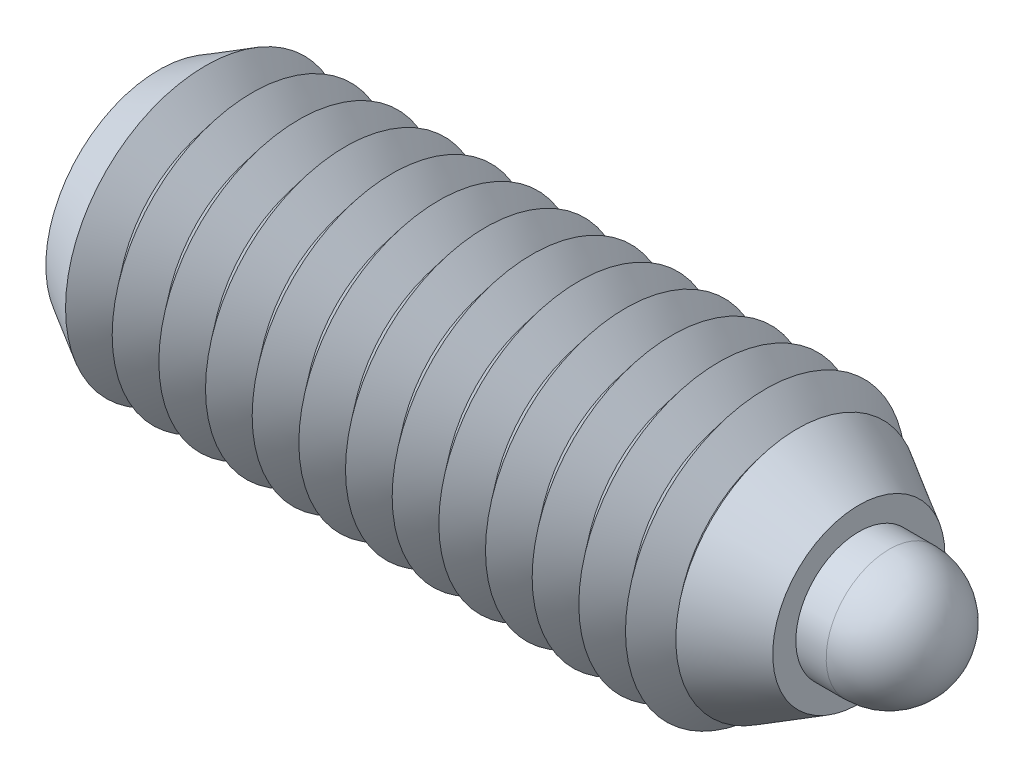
ISO-10303-21;
HEADER;
FILE_DESCRIPTION(('STEP AP214'),'2;1');
FILE_NAME('part.step','',(''),(''),'','','');
FILE_SCHEMA(('AUTOMOTIVE_DESIGN { 1 0 10303 214 1 1 1 1 }'));
ENDSEC;
DATA;
#1=APPLICATION_CONTEXT('core data for automotive mechanical design processes');
#2=APPLICATION_PROTOCOL_DEFINITION('international standard','automotive_design',2000,#1);
#3=PRODUCT_CONTEXT('',#1,'mechanical');
#4=PRODUCT('Part','Part','',(#3));
#5=PRODUCT_RELATED_PRODUCT_CATEGORY('part','',(#4));
#6=PRODUCT_DEFINITION_FORMATION('','',#4);
#7=PRODUCT_DEFINITION_CONTEXT('part definition',#1,'design');
#8=PRODUCT_DEFINITION('design','',#6,#7);
#9=PRODUCT_DEFINITION_SHAPE('','',#8);
#10=(LENGTH_UNIT() NAMED_UNIT(*) SI_UNIT(.MILLI.,.METRE.));
#11=(NAMED_UNIT(*) PLANE_ANGLE_UNIT() SI_UNIT($,.RADIAN.));
#12=(NAMED_UNIT(*) SI_UNIT($,.STERADIAN.) SOLID_ANGLE_UNIT());
#13=UNCERTAINTY_MEASURE_WITH_UNIT(LENGTH_MEASURE(1.E-05),#10,'distance_accuracy_value','');
#14=(GEOMETRIC_REPRESENTATION_CONTEXT(3) GLOBAL_UNCERTAINTY_ASSIGNED_CONTEXT((#13)) GLOBAL_UNIT_ASSIGNED_CONTEXT((#10,
#11,#12)) REPRESENTATION_CONTEXT('',''));
#15=CARTESIAN_POINT('',(0.,0.,0.));
#16=DIRECTION('',(0.,0.,1.));
#17=DIRECTION('',(1.,0.,0.));
#18=AXIS2_PLACEMENT_3D('',#15,#16,#17);
#19=CARTESIAN_POINT('',(13.9,0.,0.));
#20=DIRECTION('',(-1.,0.,0.));
#21=DIRECTION('',(0.,0.,1.));
#22=AXIS2_PLACEMENT_3D('',#19,#20,#21);
#23=CYLINDRICAL_SURFACE('',#22,1.89);
#24=CARTESIAN_POINT('',(11.5,0.,0.));
#25=DIRECTION('',(1.,0.,0.));
#26=DIRECTION('',(0.,0.,-1.));
#27=AXIS2_PLACEMENT_3D('',#24,#25,#26);
#28=CIRCLE('',#27,1.89);
#29=CARTESIAN_POINT('',(11.5,0.,-1.89));
#30=VERTEX_POINT('',#29);
#31=EDGE_CURVE('P0_E21',#30,#30,#28,.T.);
#32=ORIENTED_EDGE('',*,*,#31,.T.);
#33=EDGE_LOOP('',(#32));
#34=FACE_BOUND('',#33,.T.);
#35=CARTESIAN_POINT('',(13.36,0.,0.));
#36=DIRECTION('',(1.,0.,0.));
#37=DIRECTION('',(0.,0.,-1.));
#38=AXIS2_PLACEMENT_3D('',#35,#36,#37);
#39=CIRCLE('',#38,1.89);
#40=CARTESIAN_POINT('',(13.36,0.,-1.89));
#41=VERTEX_POINT('',#40);
#42=EDGE_CURVE('P0_E25',#41,#41,#39,.F.);
#43=ORIENTED_EDGE('',*,*,#42,.T.);
#44=EDGE_LOOP('',(#43));
#45=FACE_BOUND('',#44,.T.);
#46=ADVANCED_FACE('P0_F14',(#34,#45),#23,.T.);
#47=CARTESIAN_POINT('',(10.9,0.,0.));
#48=DIRECTION('',(1.,0.,0.));
#49=DIRECTION('',(0.,0.,-1.));
#50=AXIS2_PLACEMENT_3D('',#47,#48,#49);
#51=PLANE('',#50);
#52=CARTESIAN_POINT('',(10.9,0.,0.));
#53=DIRECTION('',(1.,0.,0.));
#54=DIRECTION('',(0.,0.,-1.));
#55=AXIS2_PLACEMENT_3D('',#52,#53,#54);
#56=CIRCLE('',#55,1.72923048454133);
#57=CARTESIAN_POINT('',(10.9,0.,-1.72923048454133));
#58=VERTEX_POINT('',#57);
#59=EDGE_CURVE('P0_E10',#58,#58,#56,.F.);
#60=ORIENTED_EDGE('',*,*,#59,.T.);
#61=EDGE_LOOP('',(#60));
#62=FACE_BOUND('',#61,.T.);
#63=ADVANCED_FACE('P0_F43',(#62),#51,.F.);
#64=CARTESIAN_POINT('',(15.65,0.,0.));
#65=DIRECTION('',(-1.,0.,0.));
#66=DIRECTION('',(0.,0.,1.));
#67=AXIS2_PLACEMENT_3D('',#64,#65,#66);
#68=CYLINDRICAL_SURFACE('',#67,1.35);
#69=CARTESIAN_POINT('',(15.65,0.,0.));
#70=DIRECTION('',(1.,0.,0.));
#71=DIRECTION('',(0.,0.,-1.));
#72=AXIS2_PLACEMENT_3D('',#69,#70,#71);
#73=CIRCLE('',#72,1.35);
#74=CARTESIAN_POINT('',(15.65,0.,-1.35));
#75=VERTEX_POINT('',#74);
#76=EDGE_CURVE('P0_E29',#75,#75,#73,.T.);
#77=ORIENTED_EDGE('',*,*,#76,.F.);
#78=EDGE_LOOP('',(#77));
#79=FACE_BOUND('',#78,.T.);
#80=CARTESIAN_POINT('',(13.9,0.,0.));
#81=DIRECTION('',(1.,0.,0.));
#82=DIRECTION('',(0.,0.,-1.));
#83=AXIS2_PLACEMENT_3D('',#80,#81,#82);
#84=CIRCLE('',#83,1.35);
#85=CARTESIAN_POINT('',(13.9,0.,-1.35));
#86=VERTEX_POINT('',#85);
#87=EDGE_CURVE('P0_E32',#86,#86,#84,.T.);
#88=ORIENTED_EDGE('',*,*,#87,.T.);
#89=EDGE_LOOP('',(#88));
#90=FACE_BOUND('',#89,.T.);
#91=ADVANCED_FACE('P0_F40',(#79,#90),#68,.T.);
#92=CARTESIAN_POINT('',(15.65,0.,0.));
#93=DIRECTION('',(-1.,0.,0.));
#94=DIRECTION('',(0.,1.,0.));
#95=AXIS2_PLACEMENT_3D('',#92,#93,#94);
#96=SPHERICAL_SURFACE('',#95,1.35);
#97=ORIENTED_EDGE('',*,*,#76,.T.);
#98=EDGE_LOOP('',(#97));
#99=FACE_BOUND('',#98,.T.);
#100=ADVANCED_FACE('P0_F38',(#99),#96,.T.);
#101=CARTESIAN_POINT('',(13.9,0.,0.));
#102=DIRECTION('',(-1.,0.,0.));
#103=DIRECTION('',(0.,0.,1.));
#104=AXIS2_PLACEMENT_3D('',#101,#102,#103);
#105=CONICAL_SURFACE('',#104,1.35,0.785398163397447);
#106=ORIENTED_EDGE('',*,*,#42,.F.);
#107=EDGE_LOOP('',(#106));
#108=FACE_BOUND('',#107,.T.);
#109=ORIENTED_EDGE('',*,*,#87,.F.);
#110=EDGE_LOOP('',(#109));
#111=FACE_BOUND('',#110,.T.);
#112=ADVANCED_FACE('P0_F47',(#108,#111),#105,.T.);
#113=CARTESIAN_POINT('',(11.5,0.,0.));
#114=DIRECTION('',(1.,0.,0.));
#115=DIRECTION('',(0.,0.,-1.));
#116=AXIS2_PLACEMENT_3D('',#113,#114,#115);
#117=CONICAL_SURFACE('',#116,1.89,0.261799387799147);
#118=ORIENTED_EDGE('',*,*,#59,.F.);
#119=EDGE_LOOP('',(#118));
#120=FACE_BOUND('',#119,.T.);
#121=ORIENTED_EDGE('',*,*,#31,.F.);
#122=EDGE_LOOP('',(#121));
#123=FACE_BOUND('',#122,.T.);
#124=ADVANCED_FACE('P0_F16',(#120,#123),#117,.T.);
#125=CLOSED_SHELL('',(#46,#63,#91,#100,#112,#124));
#126=MANIFOLD_SOLID_BREP('P0_B1',#125);
#127=CARTESIAN_POINT('',(15.,0.,0.));
#128=DIRECTION('',(-1.,0.,0.));
#129=DIRECTION('',(0.,0.,1.));
#130=AXIS2_PLACEMENT_3D('',#127,#128,#129);
#131=CONICAL_SURFACE('',#130,1.845,0.523598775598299);
#132=CARTESIAN_POINT('',(15.,0.,0.));
#133=DIRECTION('',(1.,0.,0.));
#134=DIRECTION('',(0.,0.,-1.));
#135=AXIS2_PLACEMENT_3D('',#132,#133,#134);
#136=CIRCLE('',#135,1.845);
#137=CARTESIAN_POINT('',(15.,0.,-1.845));
#138=VERTEX_POINT('',#137);
#139=EDGE_CURVE('P1_E326',#138,#138,#136,.T.);
#140=ORIENTED_EDGE('',*,*,#139,.F.);
#141=EDGE_LOOP('',(#140));
#142=FACE_BOUND('',#141,.T.);
#143=CARTESIAN_POINT('',(13.6833588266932,0.,0.));
#144=DIRECTION('',(1.,0.,0.));
#145=DIRECTION('',(0.,0.,-1.));
#146=AXIS2_PLACEMENT_3D('',#143,#144,#145);
#147=CIRCLE('',#146,2.60516313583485);
#148=CARTESIAN_POINT('',(13.6833588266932,0.,-2.60516313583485));
#149=VERTEX_POINT('',#148);
#150=EDGE_CURVE('P1_E330',#149,#149,#147,.T.);
#151=ORIENTED_EDGE('',*,*,#150,.T.);
#152=EDGE_LOOP('',(#151));
#153=FACE_BOUND('',#152,.T.);
#154=ADVANCED_FACE('P1_F15',(#142,#153),#131,.T.);
#155=CARTESIAN_POINT('',(15.,0.,0.));
#156=DIRECTION('',(1.,0.,0.));
#157=DIRECTION('',(0.,0.,-1.));
#158=AXIS2_PLACEMENT_3D('',#155,#156,#157);
#159=PLANE('',#158);
#160=ORIENTED_EDGE('',*,*,#139,.T.);
#161=EDGE_LOOP('',(#160));
#162=FACE_BOUND('',#161,.T.);
#163=CARTESIAN_POINT('',(15.,0.,0.));
#164=DIRECTION('',(1.,0.,0.));
#165=DIRECTION('',(0.,0.,-1.));
#166=AXIS2_PLACEMENT_3D('',#163,#164,#165);
#167=CIRCLE('',#166,1.35);
#168=CARTESIAN_POINT('',(15.,0.,-1.35));
#169=VERTEX_POINT('',#168);
#170=EDGE_CURVE('P1_E333',#169,#169,#167,.T.);
#171=ORIENTED_EDGE('',*,*,#170,.F.);
#172=EDGE_LOOP('',(#171));
#173=FACE_BOUND('',#172,.T.);
#174=ADVANCED_FACE('P1_F188',(#162,#173),#159,.T.);
#175=CARTESIAN_POINT('',(4.5,0.,0.));
#176=DIRECTION('',(-1.,0.,0.));
#177=DIRECTION('',(0.,0.,1.));
#178=AXIS2_PLACEMENT_3D('',#175,#176,#177);
#179=PLANE('',#178);
#180=CARTESIAN_POINT('',(4.5,0.,0.));
#181=DIRECTION('',(1.,0.,0.));
#182=DIRECTION('',(0.,0.,-1.));
#183=AXIS2_PLACEMENT_3D('',#180,#181,#182);
#184=CIRCLE('',#183,1.89);
#185=CARTESIAN_POINT('',(4.5,0.,-1.89));
#186=VERTEX_POINT('',#185);
#187=EDGE_CURVE('P1_E416',#186,#186,#184,.T.);
#188=ORIENTED_EDGE('',*,*,#187,.T.);
#189=EDGE_LOOP('',(#188));
#190=FACE_BOUND('',#189,.T.);
#191=ADVANCED_FACE('P1_F194',(#190),#179,.F.);
#192=CARTESIAN_POINT('',(15.,0.,0.));
#193=DIRECTION('',(1.,0.,0.));
#194=DIRECTION('',(0.,0.,-1.));
#195=AXIS2_PLACEMENT_3D('',#192,#193,#194);
#196=CYLINDRICAL_SURFACE('',#195,1.89);
#197=ORIENTED_EDGE('',*,*,#187,.F.);
#198=EDGE_LOOP('',(#197));
#199=FACE_BOUND('',#198,.T.);
#200=CARTESIAN_POINT('',(13.5,0.,0.));
#201=DIRECTION('',(1.,0.,0.));
#202=DIRECTION('',(0.,0.,-1.));
#203=AXIS2_PLACEMENT_3D('',#200,#201,#202);
#204=CIRCLE('',#203,1.89);
#205=CARTESIAN_POINT('',(13.5,0.,-1.89));
#206=VERTEX_POINT('',#205);
#207=EDGE_CURVE('P1_E414',#206,#206,#204,.T.);
#208=ORIENTED_EDGE('',*,*,#207,.T.);
#209=EDGE_LOOP('',(#208));
#210=FACE_BOUND('',#209,.T.);
#211=ADVANCED_FACE('P1_F683',(#199,#210),#196,.F.);
#212=CARTESIAN_POINT('',(15.,0.,0.));
#213=DIRECTION('',(-1.,0.,0.));
#214=DIRECTION('',(0.,0.,1.));
#215=AXIS2_PLACEMENT_3D('',#212,#213,#214);
#216=CONICAL_SURFACE('',#215,1.35,0.345555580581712);
#217=ORIENTED_EDGE('',*,*,#207,.F.);
#218=EDGE_LOOP('',(#217));
#219=FACE_BOUND('',#218,.T.);
#220=ORIENTED_EDGE('',*,*,#170,.T.);
#221=EDGE_LOOP('',(#220));
#222=FACE_BOUND('',#221,.T.);
#223=ADVANCED_FACE('P1_F674',(#219,#222),#216,.F.);
#224=CARTESIAN_POINT('',(13.4994813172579,0.,0.));
#225=DIRECTION('',(1.,0.,0.));
#226=DIRECTION('',(0.,0.,-1.));
#227=AXIS2_PLACEMENT_3D('',#224,#225,#226);
#228=CONICAL_SURFACE('',#227,2.37550020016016,0.895664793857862);
#229=ORIENTED_EDGE('',*,*,#150,.F.);
#230=EDGE_LOOP('',(#229));
#231=FACE_BOUND('',#230,.T.);
#232=CARTESIAN_POINT('',(13.4994813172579,0.,0.));
#233=DIRECTION('',(-1.,0.,0.));
#234=DIRECTION('',(0.,0.,1.));
#235=AXIS2_PLACEMENT_3D('',#232,#233,#234);
#236=CIRCLE('',#235,2.37550020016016);
#237=CARTESIAN_POINT('',(13.4994813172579,0.,2.37550020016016));
#238=VERTEX_POINT('',#237);
#239=EDGE_CURVE('P1_E334',#238,#238,#236,.T.);
#240=ORIENTED_EDGE('',*,*,#239,.F.);
#241=EDGE_LOOP('',(#240));
#242=FACE_BOUND('',#241,.T.);
#243=ADVANCED_FACE('P1_F666',(#231,#242),#228,.T.);
#244=CARTESIAN_POINT('',(12.9994813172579,0.,0.));
#245=DIRECTION('',(-1.,0.,0.));
#246=DIRECTION('',(0.,0.,1.));
#247=AXIS2_PLACEMENT_3D('',#244,#245,#246);
#248=CONICAL_SURFACE('',#247,3.,0.895664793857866);
#249=ORIENTED_EDGE('',*,*,#239,.T.);
#250=EDGE_LOOP('',(#249));
#251=FACE_BOUND('',#250,.T.);
#252=CARTESIAN_POINT('',(12.9994813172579,0.,0.));
#253=DIRECTION('',(-1.,0.,0.));
#254=DIRECTION('',(0.,0.,1.));
#255=AXIS2_PLACEMENT_3D('',#252,#253,#254);
#256=CIRCLE('',#255,3.);
#257=CARTESIAN_POINT('',(12.9994813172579,0.,3.));
#258=VERTEX_POINT('',#257);
#259=EDGE_CURVE('P1_E407',#258,#258,#256,.T.);
#260=ORIENTED_EDGE('',*,*,#259,.F.);
#261=EDGE_LOOP('',(#260));
#262=FACE_BOUND('',#261,.T.);
#263=ADVANCED_FACE('P1_F658',(#251,#262),#248,.T.);
#264=CARTESIAN_POINT('',(12.4994813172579,0.,0.));
#265=DIRECTION('',(1.,0.,0.));
#266=DIRECTION('',(0.,0.,-1.));
#267=AXIS2_PLACEMENT_3D('',#264,#265,#266);
#268=CONICAL_SURFACE('',#267,2.37550020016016,0.895664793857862);
#269=ORIENTED_EDGE('',*,*,#259,.T.);
#270=EDGE_LOOP('',(#269));
#271=FACE_BOUND('',#270,.T.);
#272=CARTESIAN_POINT('',(12.4994813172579,0.,0.));
#273=DIRECTION('',(-1.,0.,0.));
#274=DIRECTION('',(0.,0.,1.));
#275=AXIS2_PLACEMENT_3D('',#272,#273,#274);
#276=CIRCLE('',#275,2.37550020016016);
#277=CARTESIAN_POINT('',(12.4994813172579,0.,2.37550020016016));
#278=VERTEX_POINT('',#277);
#279=EDGE_CURVE('P1_E404',#278,#278,#276,.T.);
#280=ORIENTED_EDGE('',*,*,#279,.F.);
#281=EDGE_LOOP('',(#280));
#282=FACE_BOUND('',#281,.T.);
#283=ADVANCED_FACE('P1_F650',(#271,#282),#268,.T.);
#284=CARTESIAN_POINT('',(11.9994813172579,0.,0.));
#285=DIRECTION('',(-1.,0.,0.));
#286=DIRECTION('',(0.,0.,1.));
#287=AXIS2_PLACEMENT_3D('',#284,#285,#286);
#288=CONICAL_SURFACE('',#287,3.,0.895664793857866);
#289=ORIENTED_EDGE('',*,*,#279,.T.);
#290=EDGE_LOOP('',(#289));
#291=FACE_BOUND('',#290,.T.);
#292=CARTESIAN_POINT('',(11.9994813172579,0.,0.));
#293=DIRECTION('',(-1.,0.,0.));
#294=DIRECTION('',(0.,0.,1.));
#295=AXIS2_PLACEMENT_3D('',#292,#293,#294);
#296=CIRCLE('',#295,3.);
#297=CARTESIAN_POINT('',(11.9994813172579,0.,3.));
#298=VERTEX_POINT('',#297);
#299=EDGE_CURVE('P1_E401',#298,#298,#296,.T.);
#300=ORIENTED_EDGE('',*,*,#299,.F.);
#301=EDGE_LOOP('',(#300));
#302=FACE_BOUND('',#301,.T.);
#303=ADVANCED_FACE('P1_F642',(#291,#302),#288,.T.);
#304=CARTESIAN_POINT('',(11.4994813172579,0.,0.));
#305=DIRECTION('',(1.,0.,0.));
#306=DIRECTION('',(0.,0.,-1.));
#307=AXIS2_PLACEMENT_3D('',#304,#305,#306);
#308=CONICAL_SURFACE('',#307,2.37550020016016,0.895664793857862);
#309=ORIENTED_EDGE('',*,*,#299,.T.);
#310=EDGE_LOOP('',(#309));
#311=FACE_BOUND('',#310,.T.);
#312=CARTESIAN_POINT('',(11.4994813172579,0.,0.));
#313=DIRECTION('',(-1.,0.,0.));
#314=DIRECTION('',(0.,0.,1.));
#315=AXIS2_PLACEMENT_3D('',#312,#313,#314);
#316=CIRCLE('',#315,2.37550020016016);
#317=CARTESIAN_POINT('',(11.4994813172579,0.,2.37550020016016));
#318=VERTEX_POINT('',#317);
#319=EDGE_CURVE('P1_E398',#318,#318,#316,.T.);
#320=ORIENTED_EDGE('',*,*,#319,.F.);
#321=EDGE_LOOP('',(#320));
#322=FACE_BOUND('',#321,.T.);
#323=ADVANCED_FACE('P1_F634',(#311,#322),#308,.T.);
#324=CARTESIAN_POINT('',(10.9994813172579,0.,0.));
#325=DIRECTION('',(-1.,0.,0.));
#326=DIRECTION('',(0.,0.,1.));
#327=AXIS2_PLACEMENT_3D('',#324,#325,#326);
#328=CONICAL_SURFACE('',#327,3.,0.895664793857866);
#329=ORIENTED_EDGE('',*,*,#319,.T.);
#330=EDGE_LOOP('',(#329));
#331=FACE_BOUND('',#330,.T.);
#332=CARTESIAN_POINT('',(10.9994813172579,0.,0.));
#333=DIRECTION('',(-1.,0.,0.));
#334=DIRECTION('',(0.,0.,1.));
#335=AXIS2_PLACEMENT_3D('',#332,#333,#334);
#336=CIRCLE('',#335,3.);
#337=CARTESIAN_POINT('',(10.9994813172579,0.,3.));
#338=VERTEX_POINT('',#337);
#339=EDGE_CURVE('P1_E395',#338,#338,#336,.T.);
#340=ORIENTED_EDGE('',*,*,#339,.F.);
#341=EDGE_LOOP('',(#340));
#342=FACE_BOUND('',#341,.T.);
#343=ADVANCED_FACE('P1_F626',(#331,#342),#328,.T.);
#344=CARTESIAN_POINT('',(10.4994813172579,0.,0.));
#345=DIRECTION('',(1.,0.,0.));
#346=DIRECTION('',(0.,0.,-1.));
#347=AXIS2_PLACEMENT_3D('',#344,#345,#346);
#348=CONICAL_SURFACE('',#347,2.37550020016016,0.895664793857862);
#349=ORIENTED_EDGE('',*,*,#339,.T.);
#350=EDGE_LOOP('',(#349));
#351=FACE_BOUND('',#350,.T.);
#352=CARTESIAN_POINT('',(10.4994813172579,0.,0.));
#353=DIRECTION('',(-1.,0.,0.));
#354=DIRECTION('',(0.,0.,1.));
#355=AXIS2_PLACEMENT_3D('',#352,#353,#354);
#356=CIRCLE('',#355,2.37550020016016);
#357=CARTESIAN_POINT('',(10.4994813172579,0.,2.37550020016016));
#358=VERTEX_POINT('',#357);
#359=EDGE_CURVE('P1_E392',#358,#358,#356,.T.);
#360=ORIENTED_EDGE('',*,*,#359,.F.);
#361=EDGE_LOOP('',(#360));
#362=FACE_BOUND('',#361,.T.);
#363=ADVANCED_FACE('P1_F618',(#351,#362),#348,.T.);
#364=CARTESIAN_POINT('',(9.99948131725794,0.,0.));
#365=DIRECTION('',(-1.,0.,0.));
#366=DIRECTION('',(0.,0.,1.));
#367=AXIS2_PLACEMENT_3D('',#364,#365,#366);
#368=CONICAL_SURFACE('',#367,3.,0.895664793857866);
#369=ORIENTED_EDGE('',*,*,#359,.T.);
#370=EDGE_LOOP('',(#369));
#371=FACE_BOUND('',#370,.T.);
#372=CARTESIAN_POINT('',(9.99948131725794,0.,0.));
#373=DIRECTION('',(-1.,0.,0.));
#374=DIRECTION('',(0.,0.,1.));
#375=AXIS2_PLACEMENT_3D('',#372,#373,#374);
#376=CIRCLE('',#375,3.);
#377=CARTESIAN_POINT('',(9.99948131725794,0.,3.));
#378=VERTEX_POINT('',#377);
#379=EDGE_CURVE('P1_E389',#378,#378,#376,.T.);
#380=ORIENTED_EDGE('',*,*,#379,.F.);
#381=EDGE_LOOP('',(#380));
#382=FACE_BOUND('',#381,.T.);
#383=ADVANCED_FACE('P1_F610',(#371,#382),#368,.T.);
#384=CARTESIAN_POINT('',(9.49948131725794,0.,0.));
#385=DIRECTION('',(1.,0.,0.));
#386=DIRECTION('',(0.,0.,-1.));
#387=AXIS2_PLACEMENT_3D('',#384,#385,#386);
#388=CONICAL_SURFACE('',#387,2.37550020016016,0.895664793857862);
#389=ORIENTED_EDGE('',*,*,#379,.T.);
#390=EDGE_LOOP('',(#389));
#391=FACE_BOUND('',#390,.T.);
#392=CARTESIAN_POINT('',(9.49948131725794,0.,0.));
#393=DIRECTION('',(-1.,0.,0.));
#394=DIRECTION('',(0.,0.,1.));
#395=AXIS2_PLACEMENT_3D('',#392,#393,#394);
#396=CIRCLE('',#395,2.37550020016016);
#397=CARTESIAN_POINT('',(9.49948131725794,0.,2.37550020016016));
#398=VERTEX_POINT('',#397);
#399=EDGE_CURVE('P1_E386',#398,#398,#396,.T.);
#400=ORIENTED_EDGE('',*,*,#399,.F.);
#401=EDGE_LOOP('',(#400));
#402=FACE_BOUND('',#401,.T.);
#403=ADVANCED_FACE('P1_F602',(#391,#402),#388,.T.);
#404=CARTESIAN_POINT('',(8.99948131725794,0.,0.));
#405=DIRECTION('',(-1.,0.,0.));
#406=DIRECTION('',(0.,0.,1.));
#407=AXIS2_PLACEMENT_3D('',#404,#405,#406);
#408=CONICAL_SURFACE('',#407,3.,0.895664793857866);
#409=ORIENTED_EDGE('',*,*,#399,.T.);
#410=EDGE_LOOP('',(#409));
#411=FACE_BOUND('',#410,.T.);
#412=CARTESIAN_POINT('',(8.99948131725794,0.,0.));
#413=DIRECTION('',(-1.,0.,0.));
#414=DIRECTION('',(0.,0.,1.));
#415=AXIS2_PLACEMENT_3D('',#412,#413,#414);
#416=CIRCLE('',#415,3.);
#417=CARTESIAN_POINT('',(8.99948131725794,0.,3.));
#418=VERTEX_POINT('',#417);
#419=EDGE_CURVE('P1_E383',#418,#418,#416,.T.);
#420=ORIENTED_EDGE('',*,*,#419,.F.);
#421=EDGE_LOOP('',(#420));
#422=FACE_BOUND('',#421,.T.);
#423=ADVANCED_FACE('P1_F594',(#411,#422),#408,.T.);
#424=CARTESIAN_POINT('',(8.49948131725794,0.,0.));
#425=DIRECTION('',(1.,0.,0.));
#426=DIRECTION('',(0.,0.,-1.));
#427=AXIS2_PLACEMENT_3D('',#424,#425,#426);
#428=CONICAL_SURFACE('',#427,2.37550020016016,0.895664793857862);
#429=ORIENTED_EDGE('',*,*,#419,.T.);
#430=EDGE_LOOP('',(#429));
#431=FACE_BOUND('',#430,.T.);
#432=CARTESIAN_POINT('',(8.49948131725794,0.,0.));
#433=DIRECTION('',(-1.,0.,0.));
#434=DIRECTION('',(0.,0.,1.));
#435=AXIS2_PLACEMENT_3D('',#432,#433,#434);
#436=CIRCLE('',#435,2.37550020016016);
#437=CARTESIAN_POINT('',(8.49948131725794,0.,2.37550020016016));
#438=VERTEX_POINT('',#437);
#439=EDGE_CURVE('P1_E380',#438,#438,#436,.T.);
#440=ORIENTED_EDGE('',*,*,#439,.F.);
#441=EDGE_LOOP('',(#440));
#442=FACE_BOUND('',#441,.T.);
#443=ADVANCED_FACE('P1_F586',(#431,#442),#428,.T.);
#444=CARTESIAN_POINT('',(7.99948131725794,0.,0.));
#445=DIRECTION('',(-1.,0.,0.));
#446=DIRECTION('',(0.,0.,1.));
#447=AXIS2_PLACEMENT_3D('',#444,#445,#446);
#448=CONICAL_SURFACE('',#447,3.,0.895664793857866);
#449=ORIENTED_EDGE('',*,*,#439,.T.);
#450=EDGE_LOOP('',(#449));
#451=FACE_BOUND('',#450,.T.);
#452=CARTESIAN_POINT('',(7.99948131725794,0.,0.));
#453=DIRECTION('',(-1.,0.,0.));
#454=DIRECTION('',(0.,0.,1.));
#455=AXIS2_PLACEMENT_3D('',#452,#453,#454);
#456=CIRCLE('',#455,3.);
#457=CARTESIAN_POINT('',(7.99948131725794,0.,3.));
#458=VERTEX_POINT('',#457);
#459=EDGE_CURVE('P1_E377',#458,#458,#456,.T.);
#460=ORIENTED_EDGE('',*,*,#459,.F.);
#461=EDGE_LOOP('',(#460));
#462=FACE_BOUND('',#461,.T.);
#463=ADVANCED_FACE('P1_F578',(#451,#462),#448,.T.);
#464=CARTESIAN_POINT('',(7.49948131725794,0.,0.));
#465=DIRECTION('',(1.,0.,0.));
#466=DIRECTION('',(0.,0.,-1.));
#467=AXIS2_PLACEMENT_3D('',#464,#465,#466);
#468=CONICAL_SURFACE('',#467,2.37550020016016,0.895664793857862);
#469=ORIENTED_EDGE('',*,*,#459,.T.);
#470=EDGE_LOOP('',(#469));
#471=FACE_BOUND('',#470,.T.);
#472=CARTESIAN_POINT('',(7.49948131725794,0.,0.));
#473=DIRECTION('',(-1.,0.,0.));
#474=DIRECTION('',(0.,0.,1.));
#475=AXIS2_PLACEMENT_3D('',#472,#473,#474);
#476=CIRCLE('',#475,2.37550020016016);
#477=CARTESIAN_POINT('',(7.49948131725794,0.,2.37550020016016));
#478=VERTEX_POINT('',#477);
#479=EDGE_CURVE('P1_E374',#478,#478,#476,.T.);
#480=ORIENTED_EDGE('',*,*,#479,.F.);
#481=EDGE_LOOP('',(#480));
#482=FACE_BOUND('',#481,.T.);
#483=ADVANCED_FACE('P1_F570',(#471,#482),#468,.T.);
#484=CARTESIAN_POINT('',(6.99948131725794,0.,0.));
#485=DIRECTION('',(-1.,0.,0.));
#486=DIRECTION('',(0.,0.,1.));
#487=AXIS2_PLACEMENT_3D('',#484,#485,#486);
#488=CONICAL_SURFACE('',#487,3.,0.895664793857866);
#489=ORIENTED_EDGE('',*,*,#479,.T.);
#490=EDGE_LOOP('',(#489));
#491=FACE_BOUND('',#490,.T.);
#492=CARTESIAN_POINT('',(6.99948131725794,0.,0.));
#493=DIRECTION('',(-1.,0.,0.));
#494=DIRECTION('',(0.,0.,1.));
#495=AXIS2_PLACEMENT_3D('',#492,#493,#494);
#496=CIRCLE('',#495,3.);
#497=CARTESIAN_POINT('',(6.99948131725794,0.,3.));
#498=VERTEX_POINT('',#497);
#499=EDGE_CURVE('P1_E371',#498,#498,#496,.T.);
#500=ORIENTED_EDGE('',*,*,#499,.F.);
#501=EDGE_LOOP('',(#500));
#502=FACE_BOUND('',#501,.T.);
#503=ADVANCED_FACE('P1_F562',(#491,#502),#488,.T.);
#504=CARTESIAN_POINT('',(6.49948131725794,0.,0.));
#505=DIRECTION('',(1.,0.,0.));
#506=DIRECTION('',(0.,0.,-1.));
#507=AXIS2_PLACEMENT_3D('',#504,#505,#506);
#508=CONICAL_SURFACE('',#507,2.37550020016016,0.895664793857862);
#509=ORIENTED_EDGE('',*,*,#499,.T.);
#510=EDGE_LOOP('',(#509));
#511=FACE_BOUND('',#510,.T.);
#512=CARTESIAN_POINT('',(6.49948131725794,0.,0.));
#513=DIRECTION('',(-1.,0.,0.));
#514=DIRECTION('',(0.,0.,1.));
#515=AXIS2_PLACEMENT_3D('',#512,#513,#514);
#516=CIRCLE('',#515,2.37550020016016);
#517=CARTESIAN_POINT('',(6.49948131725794,0.,2.37550020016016));
#518=VERTEX_POINT('',#517);
#519=EDGE_CURVE('P1_E368',#518,#518,#516,.T.);
#520=ORIENTED_EDGE('',*,*,#519,.F.);
#521=EDGE_LOOP('',(#520));
#522=FACE_BOUND('',#521,.T.);
#523=ADVANCED_FACE('P1_F554',(#511,#522),#508,.T.);
#524=CARTESIAN_POINT('',(5.99948131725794,0.,0.));
#525=DIRECTION('',(-1.,0.,0.));
#526=DIRECTION('',(0.,0.,1.));
#527=AXIS2_PLACEMENT_3D('',#524,#525,#526);
#528=CONICAL_SURFACE('',#527,3.,0.895664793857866);
#529=ORIENTED_EDGE('',*,*,#519,.T.);
#530=EDGE_LOOP('',(#529));
#531=FACE_BOUND('',#530,.T.);
#532=CARTESIAN_POINT('',(5.99948131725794,0.,0.));
#533=DIRECTION('',(-1.,0.,0.));
#534=DIRECTION('',(0.,0.,1.));
#535=AXIS2_PLACEMENT_3D('',#532,#533,#534);
#536=CIRCLE('',#535,3.);
#537=CARTESIAN_POINT('',(5.99948131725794,0.,3.));
#538=VERTEX_POINT('',#537);
#539=EDGE_CURVE('P1_E365',#538,#538,#536,.T.);
#540=ORIENTED_EDGE('',*,*,#539,.F.);
#541=EDGE_LOOP('',(#540));
#542=FACE_BOUND('',#541,.T.);
#543=ADVANCED_FACE('P1_F546',(#531,#542),#528,.T.);
#544=CARTESIAN_POINT('',(5.49948131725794,0.,0.));
#545=DIRECTION('',(1.,0.,0.));
#546=DIRECTION('',(0.,0.,-1.));
#547=AXIS2_PLACEMENT_3D('',#544,#545,#546);
#548=CONICAL_SURFACE('',#547,2.37550020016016,0.895664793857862);
#549=ORIENTED_EDGE('',*,*,#539,.T.);
#550=EDGE_LOOP('',(#549));
#551=FACE_BOUND('',#550,.T.);
#552=CARTESIAN_POINT('',(5.49948131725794,0.,0.));
#553=DIRECTION('',(-1.,0.,0.));
#554=DIRECTION('',(0.,0.,1.));
#555=AXIS2_PLACEMENT_3D('',#552,#553,#554);
#556=CIRCLE('',#555,2.37550020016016);
#557=CARTESIAN_POINT('',(5.49948131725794,0.,2.37550020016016));
#558=VERTEX_POINT('',#557);
#559=EDGE_CURVE('P1_E362',#558,#558,#556,.T.);
#560=ORIENTED_EDGE('',*,*,#559,.F.);
#561=EDGE_LOOP('',(#560));
#562=FACE_BOUND('',#561,.T.);
#563=ADVANCED_FACE('P1_F538',(#551,#562),#548,.T.);
#564=CARTESIAN_POINT('',(4.99948131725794,0.,0.));
#565=DIRECTION('',(-1.,0.,0.));
#566=DIRECTION('',(0.,0.,1.));
#567=AXIS2_PLACEMENT_3D('',#564,#565,#566);
#568=CONICAL_SURFACE('',#567,3.,0.895664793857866);
#569=ORIENTED_EDGE('',*,*,#559,.T.);
#570=EDGE_LOOP('',(#569));
#571=FACE_BOUND('',#570,.T.);
#572=CARTESIAN_POINT('',(4.99948131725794,0.,0.));
#573=DIRECTION('',(-1.,0.,0.));
#574=DIRECTION('',(0.,0.,1.));
#575=AXIS2_PLACEMENT_3D('',#572,#573,#574);
#576=CIRCLE('',#575,3.);
#577=CARTESIAN_POINT('',(4.99948131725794,0.,3.));
#578=VERTEX_POINT('',#577);
#579=EDGE_CURVE('P1_E359',#578,#578,#576,.T.);
#580=ORIENTED_EDGE('',*,*,#579,.F.);
#581=EDGE_LOOP('',(#580));
#582=FACE_BOUND('',#581,.T.);
#583=ADVANCED_FACE('P1_F530',(#571,#582),#568,.T.);
#584=CARTESIAN_POINT('',(4.49948131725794,0.,0.));
#585=DIRECTION('',(1.,0.,0.));
#586=DIRECTION('',(0.,0.,-1.));
#587=AXIS2_PLACEMENT_3D('',#584,#585,#586);
#588=CONICAL_SURFACE('',#587,2.37550020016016,0.895664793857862);
#589=ORIENTED_EDGE('',*,*,#579,.T.);
#590=EDGE_LOOP('',(#589));
#591=FACE_BOUND('',#590,.T.);
#592=CARTESIAN_POINT('',(4.49948131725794,0.,0.));
#593=DIRECTION('',(-1.,0.,0.));
#594=DIRECTION('',(0.,0.,1.));
#595=AXIS2_PLACEMENT_3D('',#592,#593,#594);
#596=CIRCLE('',#595,2.37550020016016);
#597=CARTESIAN_POINT('',(4.49948131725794,0.,2.37550020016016));
#598=VERTEX_POINT('',#597);
#599=EDGE_CURVE('P1_E356',#598,#598,#596,.T.);
#600=ORIENTED_EDGE('',*,*,#599,.F.);
#601=EDGE_LOOP('',(#600));
#602=FACE_BOUND('',#601,.T.);
#603=ADVANCED_FACE('P1_F522',(#591,#602),#588,.T.);
#604=CARTESIAN_POINT('',(3.99948131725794,0.,0.));
#605=DIRECTION('',(-1.,0.,0.));
#606=DIRECTION('',(0.,0.,1.));
#607=AXIS2_PLACEMENT_3D('',#604,#605,#606);
#608=CONICAL_SURFACE('',#607,3.,0.895664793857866);
#609=ORIENTED_EDGE('',*,*,#599,.T.);
#610=EDGE_LOOP('',(#609));
#611=FACE_BOUND('',#610,.T.);
#612=CARTESIAN_POINT('',(3.99948131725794,0.,0.));
#613=DIRECTION('',(-1.,0.,0.));
#614=DIRECTION('',(0.,0.,1.));
#615=AXIS2_PLACEMENT_3D('',#612,#613,#614);
#616=CIRCLE('',#615,3.);
#617=CARTESIAN_POINT('',(3.99948131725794,0.,3.));
#618=VERTEX_POINT('',#617);
#619=EDGE_CURVE('P1_E353',#618,#618,#616,.T.);
#620=ORIENTED_EDGE('',*,*,#619,.F.);
#621=EDGE_LOOP('',(#620));
#622=FACE_BOUND('',#621,.T.);
#623=ADVANCED_FACE('P1_F514',(#611,#622),#608,.T.);
#624=CARTESIAN_POINT('',(3.49948131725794,0.,0.));
#625=DIRECTION('',(1.,0.,0.));
#626=DIRECTION('',(0.,0.,-1.));
#627=AXIS2_PLACEMENT_3D('',#624,#625,#626);
#628=CONICAL_SURFACE('',#627,2.37550020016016,0.895664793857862);
#629=ORIENTED_EDGE('',*,*,#619,.T.);
#630=EDGE_LOOP('',(#629));
#631=FACE_BOUND('',#630,.T.);
#632=CARTESIAN_POINT('',(3.49948131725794,0.,0.));
#633=DIRECTION('',(-1.,0.,0.));
#634=DIRECTION('',(0.,0.,1.));
#635=AXIS2_PLACEMENT_3D('',#632,#633,#634);
#636=CIRCLE('',#635,2.37550020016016);
#637=CARTESIAN_POINT('',(3.49948131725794,0.,2.37550020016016));
#638=VERTEX_POINT('',#637);
#639=EDGE_CURVE('P1_E350',#638,#638,#636,.T.);
#640=ORIENTED_EDGE('',*,*,#639,.F.);
#641=EDGE_LOOP('',(#640));
#642=FACE_BOUND('',#641,.T.);
#643=ADVANCED_FACE('P1_F506',(#631,#642),#628,.T.);
#644=CARTESIAN_POINT('',(2.99948131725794,0.,0.));
#645=DIRECTION('',(-1.,0.,0.));
#646=DIRECTION('',(0.,0.,1.));
#647=AXIS2_PLACEMENT_3D('',#644,#645,#646);
#648=CONICAL_SURFACE('',#647,3.,0.895664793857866);
#649=ORIENTED_EDGE('',*,*,#639,.T.);
#650=EDGE_LOOP('',(#649));
#651=FACE_BOUND('',#650,.T.);
#652=CARTESIAN_POINT('',(2.99948131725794,0.,0.));
#653=DIRECTION('',(-1.,0.,0.));
#654=DIRECTION('',(0.,0.,1.));
#655=AXIS2_PLACEMENT_3D('',#652,#653,#654);
#656=CIRCLE('',#655,3.);
#657=CARTESIAN_POINT('',(2.99948131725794,0.,3.));
#658=VERTEX_POINT('',#657);
#659=EDGE_CURVE('P1_E342',#658,#658,#656,.T.);
#660=ORIENTED_EDGE('',*,*,#659,.F.);
#661=EDGE_LOOP('',(#660));
#662=FACE_BOUND('',#661,.T.);
#663=ADVANCED_FACE('P1_F498',(#651,#662),#648,.T.);
#664=CARTESIAN_POINT('',(2.49948131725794,0.,0.));
#665=DIRECTION('',(1.,0.,0.));
#666=DIRECTION('',(0.,0.,-1.));
#667=AXIS2_PLACEMENT_3D('',#664,#665,#666);
#668=CONICAL_SURFACE('',#667,2.37550020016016,0.895664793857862);
#669=ORIENTED_EDGE('',*,*,#659,.T.);
#670=EDGE_LOOP('',(#669));
#671=FACE_BOUND('',#670,.T.);
#672=CARTESIAN_POINT('',(2.49948131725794,0.,0.));
#673=DIRECTION('',(-1.,0.,0.));
#674=DIRECTION('',(0.,0.,1.));
#675=AXIS2_PLACEMENT_3D('',#672,#673,#674);
#676=CIRCLE('',#675,2.37550020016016);
#677=CARTESIAN_POINT('',(2.49948131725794,0.,2.37550020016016));
#678=VERTEX_POINT('',#677);
#679=EDGE_CURVE('P1_E338',#678,#678,#676,.T.);
#680=ORIENTED_EDGE('',*,*,#679,.F.);
#681=EDGE_LOOP('',(#680));
#682=FACE_BOUND('',#681,.T.);
#683=ADVANCED_FACE('P1_F490',(#671,#682),#668,.T.);
#684=CARTESIAN_POINT('',(1.99948131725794,0.,0.));
#685=DIRECTION('',(-1.,0.,0.));
#686=DIRECTION('',(0.,0.,1.));
#687=AXIS2_PLACEMENT_3D('',#684,#685,#686);
#688=CONICAL_SURFACE('',#687,3.,0.895664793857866);
#689=ORIENTED_EDGE('',*,*,#679,.T.);
#690=EDGE_LOOP('',(#689));
#691=FACE_BOUND('',#690,.T.);
#692=CARTESIAN_POINT('',(1.99948131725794,0.,0.));
#693=DIRECTION('',(-1.,0.,0.));
#694=DIRECTION('',(0.,0.,1.));
#695=AXIS2_PLACEMENT_3D('',#692,#693,#694);
#696=CIRCLE('',#695,3.);
#697=CARTESIAN_POINT('',(1.99948131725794,0.,3.));
#698=VERTEX_POINT('',#697);
#699=EDGE_CURVE('P1_E126',#698,#698,#696,.T.);
#700=ORIENTED_EDGE('',*,*,#699,.F.);
#701=EDGE_LOOP('',(#700));
#702=FACE_BOUND('',#701,.T.);
#703=ADVANCED_FACE('P1_F484',(#691,#702),#688,.T.);
#704=CARTESIAN_POINT('',(1.49948131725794,0.,0.));
#705=DIRECTION('',(1.,0.,0.));
#706=DIRECTION('',(0.,0.,-1.));
#707=AXIS2_PLACEMENT_3D('',#704,#705,#706);
#708=CONICAL_SURFACE('',#707,2.37550020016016,0.895664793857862);
#709=ORIENTED_EDGE('',*,*,#699,.T.);
#710=EDGE_LOOP('',(#709));
#711=FACE_BOUND('',#710,.T.);
#712=CARTESIAN_POINT('',(1.49948131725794,0.,0.));
#713=DIRECTION('',(-1.,0.,0.));
#714=DIRECTION('',(0.,0.,1.));
#715=AXIS2_PLACEMENT_3D('',#712,#713,#714);
#716=CIRCLE('',#715,2.37550020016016);
#717=CARTESIAN_POINT('',(1.49948131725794,0.,2.37550020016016));
#718=VERTEX_POINT('',#717);
#719=EDGE_CURVE('P1_E123',#718,#718,#716,.T.);
#720=ORIENTED_EDGE('',*,*,#719,.F.);
#721=EDGE_LOOP('',(#720));
#722=FACE_BOUND('',#721,.T.);
#723=ADVANCED_FACE('P1_F477',(#711,#722),#708,.T.);
#724=CARTESIAN_POINT('',(0.999481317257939,0.,0.));
#725=DIRECTION('',(-1.,0.,0.));
#726=DIRECTION('',(0.,0.,1.));
#727=AXIS2_PLACEMENT_3D('',#724,#725,#726);
#728=CONICAL_SURFACE('',#727,3.,0.895664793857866);
#729=CARTESIAN_POINT('',(0.999727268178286,0.,0.));
#730=DIRECTION('',(-1.,0.,0.));
#731=DIRECTION('',(0.,0.,1.));
#732=AXIS2_PLACEMENT_3D('',#729,#730,#731);
#733=CIRCLE('',#732,2.99969280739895);
#734=CARTESIAN_POINT('',(0.999727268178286,0.,2.99969280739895));
#735=VERTEX_POINT('',#734);
#736=EDGE_CURVE('P1_E336',#735,#735,#733,.T.);
#737=ORIENTED_EDGE('',*,*,#736,.F.);
#738=EDGE_LOOP('',(#737));
#739=FACE_BOUND('',#738,.T.);
#740=ORIENTED_EDGE('',*,*,#719,.T.);
#741=EDGE_LOOP('',(#740));
#742=FACE_BOUND('',#741,.T.);
#743=ADVANCED_FACE('P1_F145',(#739,#742),#728,.T.);
#744=CARTESIAN_POINT('',(0.,0.,0.));
#745=DIRECTION('',(1.,0.,0.));
#746=DIRECTION('',(0.,0.,-1.));
#747=AXIS2_PLACEMENT_3D('',#744,#745,#746);
#748=PLANE('',#747);
#749=CARTESIAN_POINT('',(0.,0.,0.));
#750=DIRECTION('',(1.,0.,0.));
#751=DIRECTION('',(0.,0.,-1.));
#752=AXIS2_PLACEMENT_3D('',#749,#750,#751);
#753=CIRCLE('',#752,2.4225);
#754=CARTESIAN_POINT('',(0.,0.,-2.4225));
#755=VERTEX_POINT('',#754);
#756=EDGE_CURVE('P1_E249',#755,#755,#753,.F.);
#757=ORIENTED_EDGE('',*,*,#756,.T.);
#758=EDGE_LOOP('',(#757));
#759=FACE_BOUND('',#758,.T.);
#760=CARTESIAN_POINT('',(0.,0.,0.));
#761=DIRECTION('',(1.,0.,0.));
#762=DIRECTION('',(0.,0.,-1.));
#763=AXIS2_PLACEMENT_3D('',#760,#761,#762);
#764=CIRCLE('',#763,1.73205080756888);
#765=CARTESIAN_POINT('',(0.,-0.866025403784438,-1.5));
#766=VERTEX_POINT('',#765);
#767=CARTESIAN_POINT('',(0.,0.866025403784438,-1.5));
#768=VERTEX_POINT('',#767);
#769=EDGE_CURVE('P1_E19',#766,#768,#764,.T.);
#770=ORIENTED_EDGE('',*,*,#769,.T.);
#771=CARTESIAN_POINT('',(0.,1.73205080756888,0.));
#772=VERTEX_POINT('',#771);
#773=EDGE_CURVE('P1_E10',#768,#772,#764,.T.);
#774=ORIENTED_EDGE('',*,*,#773,.T.);
#775=CARTESIAN_POINT('',(0.,0.,0.));
#776=DIRECTION('',(-1.,0.,0.));
#777=DIRECTION('',(0.,0.,1.));
#778=AXIS2_PLACEMENT_3D('',#775,#776,#777);
#779=CIRCLE('',#778,1.73205080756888);
#780=CARTESIAN_POINT('',(0.,0.866025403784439,1.5));
#781=VERTEX_POINT('',#780);
#782=EDGE_CURVE('P1_E35',#781,#772,#779,.T.);
#783=ORIENTED_EDGE('',*,*,#782,.F.);
#784=CARTESIAN_POINT('',(0.,-0.86602540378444,1.5));
#785=VERTEX_POINT('',#784);
#786=EDGE_CURVE('P1_E24',#781,#785,#764,.T.);
#787=ORIENTED_EDGE('',*,*,#786,.T.);
#788=CARTESIAN_POINT('',(0.,-1.73205080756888,0.));
#789=VERTEX_POINT('',#788);
#790=EDGE_CURVE('P1_E250',#785,#789,#764,.T.);
#791=ORIENTED_EDGE('',*,*,#790,.T.);
#792=EDGE_CURVE('P1_E245',#789,#766,#764,.T.);
#793=ORIENTED_EDGE('',*,*,#792,.T.);
#794=EDGE_LOOP('',(#770,#774,#783,#787,#791,#793));
#795=FACE_BOUND('',#794,.T.);
#796=ADVANCED_FACE('P1_F103',(#759,#795),#748,.F.);
#797=CARTESIAN_POINT('',(1.00025934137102,0.,0.));
#798=DIRECTION('',(1.,0.,0.));
#799=DIRECTION('',(0.,0.,-1.));
#800=AXIS2_PLACEMENT_3D('',#797,#798,#799);
#801=CONICAL_SURFACE('',#800,3.,0.5235987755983);
#802=ORIENTED_EDGE('',*,*,#756,.F.);
#803=EDGE_LOOP('',(#802));
#804=FACE_BOUND('',#803,.T.);
#805=ORIENTED_EDGE('',*,*,#736,.T.);
#806=EDGE_LOOP('',(#805));
#807=FACE_BOUND('',#806,.T.);
#808=ADVANCED_FACE('P1_F17',(#804,#807),#801,.T.);
#809=CARTESIAN_POINT('',(0.,0.,0.));
#810=DIRECTION('',(-1.,0.,0.));
#811=DIRECTION('',(0.,0.,1.));
#812=AXIS2_PLACEMENT_3D('',#809,#810,#811);
#813=CONICAL_SURFACE('',#812,1.73205080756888,1.0471975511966);
#814=ORIENTED_EDGE('',*,*,#769,.F.);
#815=CARTESIAN_POINT('',(-0.55775293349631,-2.24271768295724,-1.5));
#816=CARTESIAN_POINT('',(-0.526676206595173,-2.17794242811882,-1.5));
#817=CARTESIAN_POINT('',(-0.49592234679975,-2.11300950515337,-1.5));
#818=CARTESIAN_POINT('',(-0.435243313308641,-1.98274395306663,-1.5));
#819=CARTESIAN_POINT('',(-0.405318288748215,-1.91741125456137,-1.5));
#820=CARTESIAN_POINT('',(-0.346312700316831,-1.78588718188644,-1.5));
#821=CARTESIAN_POINT('',(-0.317238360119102,-1.71969300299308,-1.5));
#822=CARTESIAN_POINT('',(-0.260394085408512,-1.58675026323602,-1.5));
#823=CARTESIAN_POINT('',(-0.232624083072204,-1.52000173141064,-1.5));
#824=CARTESIAN_POINT('',(-0.178025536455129,-1.38408099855,-1.5));
#825=CARTESIAN_POINT('',(-0.151240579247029,-1.31489105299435,-1.5));
#826=CARTESIAN_POINT('',(-0.0999065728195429,-1.17568930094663,-1.5));
#827=CARTESIAN_POINT('',(-0.075357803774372,-1.10567739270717,-1.5));
#828=CARTESIAN_POINT('',(-0.00610108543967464,-0.894522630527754,-1.5));
#829=CARTESIAN_POINT('',(0.0343797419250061,-0.751874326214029,-1.5));
#830=CARTESIAN_POINT('',(0.0813355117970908,-0.535047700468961,-1.5));
#831=CARTESIAN_POINT('',(0.0946871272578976,-0.462365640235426,-1.5));
#832=CARTESIAN_POINT('',(0.115886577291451,-0.316183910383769,-1.5));
#833=CARTESIAN_POINT('',(0.123734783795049,-0.242684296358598,-1.5));
#834=CARTESIAN_POINT('',(0.133201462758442,-0.0961589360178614,-1.5));
#835=CARTESIAN_POINT('',(0.134893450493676,-0.0231380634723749,-1.5));
#836=CARTESIAN_POINT('',(0.132100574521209,0.122783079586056,-1.5));
#837=CARTESIAN_POINT('',(0.12761532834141,0.19568334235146,-1.5));
#838=CARTESIAN_POINT('',(0.109322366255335,0.375553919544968,-1.5));
#839=CARTESIAN_POINT('',(0.0920865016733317,0.482175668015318,-1.5));
#840=CARTESIAN_POINT('',(0.0476401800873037,0.69334577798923,-1.5));
#841=CARTESIAN_POINT('',(0.0204177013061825,0.797891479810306,-1.5));
#842=CARTESIAN_POINT('',(-0.0260849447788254,0.954251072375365,-1.5));
#843=CARTESIAN_POINT('',(-0.0427475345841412,1.00687320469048,-1.5));
#844=CARTESIAN_POINT('',(-0.0776140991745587,1.11156970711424,-1.5));
#845=CARTESIAN_POINT('',(-0.0958171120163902,1.16364439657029,-1.5));
#846=CARTESIAN_POINT('',(-0.13350016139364,1.26731560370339,-1.5));
#847=CARTESIAN_POINT('',(-0.152979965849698,1.31891220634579,-1.5));
#848=CARTESIAN_POINT('',(-0.193005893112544,1.42169884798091,-1.5));
#849=CARTESIAN_POINT('',(-0.213552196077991,1.47288881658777,-1.5));
#850=CARTESIAN_POINT('',(-0.267313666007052,1.60355339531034,-1.5));
#851=CARTESIAN_POINT('',(-0.301163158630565,1.68276673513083,-1.5));
#852=CARTESIAN_POINT('',(-0.370493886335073,1.84047808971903,-1.5));
#853=CARTESIAN_POINT('',(-0.405975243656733,1.91897605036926,-1.5));
#854=CARTESIAN_POINT('',(-0.514291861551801,2.15363522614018,-1.5));
#855=CARTESIAN_POINT('',(-0.588988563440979,2.30893552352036,-1.5));
#856=CARTESIAN_POINT('',(-0.741514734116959,2.61820933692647,-1.5));
#857=CARTESIAN_POINT('',(-0.819347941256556,2.77218098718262,-1.5));
#858=CARTESIAN_POINT('',(-0.977015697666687,3.07906936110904,-1.5));
#859=CARTESIAN_POINT('',(-1.05684999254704,3.231986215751,-1.5));
#860=CARTESIAN_POINT('',(-1.21029683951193,3.52269097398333,-1.5));
#861=CARTESIAN_POINT('',(-1.28378541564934,3.66054454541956,-1.5));
#862=CARTESIAN_POINT('',(-1.43159989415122,3.93580825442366,-1.5));
#863=CARTESIAN_POINT('',(-1.50592582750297,4.07321837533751,-1.5));
#864=CARTESIAN_POINT('',(-1.65501518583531,4.34734790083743,-1.5));
#865=CARTESIAN_POINT('',(-1.7297770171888,4.48406817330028,-1.5));
#866=CARTESIAN_POINT('',(-1.87978727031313,4.75723230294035,-1.5));
#867=CARTESIAN_POINT('',(-1.95503566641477,4.89367617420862,-1.5));
#868=CARTESIAN_POINT('',(-2.03046248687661,5.03002074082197,-1.5));
#869=B_SPLINE_CURVE_WITH_KNOTS('',3,(#815,#816,#817,#818,#819,#820,#821,#822,#823,#824,#825,
#826,#827,#828,#829,#830,#831,#832,#833,#834,#835,#836,#837,#838,#839,#840,#841,#842,#843,#844,
#845,#846,#847,#848,#849,#850,#851,#852,#853,#854,#855,#856,#857,#858,#859,#860,#861,#862,#863,
#864,#865,#866,#867,#868),.UNSPECIFIED.,.F.,.F.,(4,2,2,2,2,2,2,2,2,2,2,2,2,2,2,2,2,2,2,2,2,2,2,
2,2,2,4),(0.,0.215535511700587,0.431109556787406,0.647991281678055,0.86486171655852,
1.08740133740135,1.30996880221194,1.75384817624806,1.97537465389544,2.19688615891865,
2.41574361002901,2.63461461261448,2.95796757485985,3.28171107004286,3.44728443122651,
3.61275514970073,3.77819587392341,3.94366463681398,4.20206568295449,4.46048611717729,
4.97741233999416,5.4949740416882,6.01247027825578,6.48112210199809,6.94979132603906,
7.41726847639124,7.88472116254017),.UNSPECIFIED.);
#870=EDGE_CURVE('P1_E93',#768,#766,#869,.F.);
#871=ORIENTED_EDGE('',*,*,#870,.F.);
#872=EDGE_LOOP('',(#814,#871));
#873=FACE_BOUND('',#872,.T.);
#874=ADVANCED_FACE('P1_F248',(#873),#813,.F.);
#875=ORIENTED_EDGE('',*,*,#792,.F.);
#876=CARTESIAN_POINT('',(-6.66733328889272E-05,-0.8659099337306,-1.5002));
#877=CARTESIAN_POINT('',(0.0219171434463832,-0.903968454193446,-1.43428070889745));
#878=CARTESIAN_POINT('',(0.0419111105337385,-0.942355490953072,-1.36779241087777));
#879=CARTESIAN_POINT('',(0.0768118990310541,-1.01979436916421,-1.23366433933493));
#880=CARTESIAN_POINT('',(0.0917063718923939,-1.05884758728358,-1.16602218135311));
#881=CARTESIAN_POINT('',(0.114893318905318,-1.13646999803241,-1.03157622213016));
#882=CARTESIAN_POINT('',(0.123340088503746,-1.17502724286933,-0.964793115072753));
#883=CARTESIAN_POINT('',(0.133426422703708,-1.25232329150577,-0.83091243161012));
#884=CARTESIAN_POINT('',(0.13507433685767,-1.29106181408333,-0.763815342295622));
#885=CARTESIAN_POINT('',(0.131658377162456,-1.363455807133,-0.638425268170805));
#886=CARTESIAN_POINT('',(0.127433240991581,-1.39712207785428,-0.580113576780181));
#887=CARTESIAN_POINT('',(0.11403822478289,-1.46423526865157,-0.463870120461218));
#888=CARTESIAN_POINT('',(0.104863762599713,-1.49768195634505,-0.405938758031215));
#889=CARTESIAN_POINT('',(0.0819268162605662,-1.56493368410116,-0.289455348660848));
#890=CARTESIAN_POINT('',(0.0680670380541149,-1.59873020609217,-0.230918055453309));
#891=CARTESIAN_POINT('',(0.0366102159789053,-1.6658189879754,-0.114716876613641));
#892=CARTESIAN_POINT('',(0.0190205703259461,-1.699112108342,-0.05705150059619));
#893=CARTESIAN_POINT('',(-6.66733328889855E-05,-1.73216627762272,0.000199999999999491));
#894=B_SPLINE_CURVE_WITH_KNOTS('',3,(#876,#877,#878,#879,#880,#881,#882,#883,#884,#885,#886,
#887,#888,#889,#890,#891,#892,#893),.UNSPECIFIED.,.F.,.F.,(4,2,2,2,2,2,2,2,4),(0.,
0.237777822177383,0.476127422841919,0.70857706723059,0.94074115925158,1.1429435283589,
1.34533342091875,1.55221450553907,1.75868901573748),.UNSPECIFIED.);
#895=EDGE_CURVE('P1_E163',#766,#789,#894,.T.);
#896=ORIENTED_EDGE('',*,*,#895,.F.);
#897=EDGE_LOOP('',(#875,#896));
#898=FACE_BOUND('',#897,.T.);
#899=ADVANCED_FACE('P1_F244',(#898),#813,.F.);
#900=ORIENTED_EDGE('',*,*,#790,.F.);
#901=CARTESIAN_POINT('',(-6.66733328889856E-05,-1.73216627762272,-0.000200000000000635));
#902=CARTESIAN_POINT('',(0.0219171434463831,-1.69410775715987,0.065719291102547));
#903=CARTESIAN_POINT('',(0.0419111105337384,-1.65572072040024,0.132207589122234));
#904=CARTESIAN_POINT('',(0.0768118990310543,-1.5782818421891,0.266335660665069));
#905=CARTESIAN_POINT('',(0.0917063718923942,-1.53922862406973,0.333977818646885));
#906=CARTESIAN_POINT('',(0.114893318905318,-1.4616062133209,0.468423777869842));
#907=CARTESIAN_POINT('',(0.123340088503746,-1.42304896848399,0.535206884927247));
#908=CARTESIAN_POINT('',(0.133426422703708,-1.34575291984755,0.66908756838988));
#909=CARTESIAN_POINT('',(0.13507433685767,-1.30701439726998,0.736184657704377));
#910=CARTESIAN_POINT('',(0.131658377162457,-1.23462040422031,0.861574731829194));
#911=CARTESIAN_POINT('',(0.127433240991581,-1.20095413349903,0.919886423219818));
#912=CARTESIAN_POINT('',(0.11403822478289,-1.13384094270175,1.03612987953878));
#913=CARTESIAN_POINT('',(0.104863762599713,-1.10039425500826,1.09406124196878));
#914=CARTESIAN_POINT('',(0.0819268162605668,-1.03314252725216,1.21054465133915));
#915=CARTESIAN_POINT('',(0.0680670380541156,-0.99934600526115,1.26908194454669));
#916=CARTESIAN_POINT('',(0.0366102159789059,-0.932257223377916,1.38528312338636));
#917=CARTESIAN_POINT('',(0.0190205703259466,-0.89896410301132,1.44294849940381));
#918=CARTESIAN_POINT('',(-6.6673332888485E-05,-0.8659099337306,1.5002));
#919=B_SPLINE_CURVE_WITH_KNOTS('',3,(#901,#902,#903,#904,#905,#906,#907,#908,#909,#910,#911,
#912,#913,#914,#915,#916,#917,#918),.UNSPECIFIED.,.F.,.F.,(4,2,2,2,2,2,2,2,4),(0.,
0.237777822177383,0.476127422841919,0.70857706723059,0.94074115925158,1.1429435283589,
1.34533342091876,1.55221450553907,1.75868901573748),.UNSPECIFIED.);
#920=EDGE_CURVE('P1_E156',#789,#785,#919,.T.);
#921=ORIENTED_EDGE('',*,*,#920,.F.);
#922=EDGE_LOOP('',(#900,#921));
#923=FACE_BOUND('',#922,.T.);
#924=ADVANCED_FACE('P1_F252',(#923),#813,.F.);
#925=ORIENTED_EDGE('',*,*,#786,.F.);
#926=CARTESIAN_POINT('',(-0.557752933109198,-2.2427176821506,1.5));
#927=CARTESIAN_POINT('',(-0.526676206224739,-2.17794242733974,1.5));
#928=CARTESIAN_POINT('',(-0.495922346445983,-2.11300950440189,1.5));
#929=CARTESIAN_POINT('',(-0.435243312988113,-1.98274395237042,1.5));
#930=CARTESIAN_POINT('',(-0.405318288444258,-1.91741125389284,1.5));
#931=CARTESIAN_POINT('',(-0.346312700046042,-1.78588718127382,1.5));
#932=CARTESIAN_POINT('',(-0.317238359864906,-1.71969300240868,1.5));
#933=CARTESIAN_POINT('',(-0.260394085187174,-1.58675026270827,1.5));
#934=CARTESIAN_POINT('',(-0.232624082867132,-1.52000173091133,1.5));
#935=CARTESIAN_POINT('',(-0.178025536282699,-1.38408099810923,1.5));
#936=CARTESIAN_POINT('',(-0.151240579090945,-1.31489105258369,1.5));
#937=CARTESIAN_POINT('',(-0.0999065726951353,-1.17568930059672,1.5));
#938=CARTESIAN_POINT('',(-0.075357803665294,-1.10567739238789,1.5));
#939=CARTESIAN_POINT('',(-0.00610108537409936,-0.89452263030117,1.5));
#940=CARTESIAN_POINT('',(0.0343797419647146,-0.751874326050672,1.5));
#941=CARTESIAN_POINT('',(0.0813355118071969,-0.535047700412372,1.5));
#942=CARTESIAN_POINT('',(0.094687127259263,-0.46236564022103,1.5));
#943=CARTESIAN_POINT('',(0.115886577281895,-0.316183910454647,1.5));
#944=CARTESIAN_POINT('',(0.123734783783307,-0.242684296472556,1.5));
#945=CARTESIAN_POINT('',(0.133201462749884,-0.09615893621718,1.5));
#946=CARTESIAN_POINT('',(0.134893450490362,-0.0231380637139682,1.5));
#947=CARTESIAN_POINT('',(0.13210057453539,0.122783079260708,1.5));
#948=CARTESIAN_POINT('',(0.127615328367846,0.195683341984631,1.5));
#949=CARTESIAN_POINT('',(0.109322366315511,0.375553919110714,1.5));
#950=CARTESIAN_POINT('',(0.0920865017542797,0.482175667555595,1.5));
#951=CARTESIAN_POINT('',(0.0476401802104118,0.693345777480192,1.5));
#952=CARTESIAN_POINT('',(0.020417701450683,0.797891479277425,1.5));
#953=CARTESIAN_POINT('',(-0.026084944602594,0.954251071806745,1.5));
#954=CARTESIAN_POINT('',(-0.0427475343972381,1.00687320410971,1.5));
#955=CARTESIAN_POINT('',(-0.0776140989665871,1.11156970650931,1.5));
#956=CARTESIAN_POINT('',(-0.0958171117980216,1.16364439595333,1.5));
#957=CARTESIAN_POINT('',(-0.13350016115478,1.26731560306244,1.5));
#958=CARTESIAN_POINT('',(-0.152979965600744,1.31891220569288,1.5));
#959=CARTESIAN_POINT('',(-0.193005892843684,1.42169884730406,1.5));
#960=CARTESIAN_POINT('',(-0.213552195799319,1.47288881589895,1.5));
#961=CARTESIAN_POINT('',(-0.267313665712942,1.60355339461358,1.5));
#962=CARTESIAN_POINT('',(-0.301163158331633,1.68276673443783,1.5));
#963=CARTESIAN_POINT('',(-0.370493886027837,1.84047808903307,1.5));
#964=CARTESIAN_POINT('',(-0.405975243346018,1.91897604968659,1.5));
#965=CARTESIAN_POINT('',(-0.514291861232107,2.15363522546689,1.5));
#966=CARTESIAN_POINT('',(-0.588988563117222,2.3089355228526,1.5));
#967=CARTESIAN_POINT('',(-0.741514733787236,2.61820933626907,1.5));
#968=CARTESIAN_POINT('',(-0.819347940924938,2.77218098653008,1.5));
#969=CARTESIAN_POINT('',(-0.977015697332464,3.07906936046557,1.5));
#970=CARTESIAN_POINT('',(-1.05684999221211,3.23198621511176,1.5));
#971=CARTESIAN_POINT('',(-1.2102968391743,3.52269097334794,1.5));
#972=CARTESIAN_POINT('',(-1.28378541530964,3.66054454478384,1.5));
#973=CARTESIAN_POINT('',(-1.43159989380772,3.93580825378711,1.5));
#974=CARTESIAN_POINT('',(-1.50592582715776,4.07321837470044,1.5));
#975=CARTESIAN_POINT('',(-1.65501518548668,4.34734790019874,1.5));
#976=CARTESIAN_POINT('',(-1.72977701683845,4.48406817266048,1.5));
#977=CARTESIAN_POINT('',(-1.87978726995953,4.75723230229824,1.5));
#978=CARTESIAN_POINT('',(-1.95503566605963,4.89367617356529,1.5));
#979=CARTESIAN_POINT('',(-2.03046248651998,5.03002074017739,1.5));
#980=B_SPLINE_CURVE_WITH_KNOTS('',3,(#926,#927,#928,#929,#930,#931,#932,#933,#934,#935,#936,
#937,#938,#939,#940,#941,#942,#943,#944,#945,#946,#947,#948,#949,#950,#951,#952,#953,#954,#955,
#956,#957,#958,#959,#960,#961,#962,#963,#964,#965,#966,#967,#968,#969,#970,#971,#972,#973,#974,
#975,#976,#977,#978,#979),.UNSPECIFIED.,.F.,.F.,(4,2,2,2,2,2,2,2,2,2,2,2,2,2,2,2,2,2,2,2,2,2,2,
2,2,2,4),(0.,0.215535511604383,0.431109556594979,0.647991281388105,0.864861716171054,
1.08740133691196,1.30996880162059,1.75384817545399,1.97537465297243,2.19688615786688,
2.41574360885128,2.63461461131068,2.95796757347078,3.28171106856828,3.44728442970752,
3.61275514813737,3.77819587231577,3.94366463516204,4.20206568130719,4.46048611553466,
4.97741233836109,5.49497404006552,6.01247027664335,6.48112210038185,6.94979132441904,
7.41726847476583,7.88472116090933),.UNSPECIFIED.);
#981=EDGE_CURVE('P1_E100',#785,#781,#980,.T.);
#982=ORIENTED_EDGE('',*,*,#981,.F.);
#983=EDGE_LOOP('',(#925,#982));
#984=FACE_BOUND('',#983,.T.);
#985=ADVANCED_FACE('P1_F144',(#984),#813,.F.);
#986=ORIENTED_EDGE('',*,*,#782,.T.);
#987=CARTESIAN_POINT('',(-6.66733328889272E-05,0.865909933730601,1.5002));
#988=CARTESIAN_POINT('',(0.021917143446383,0.903968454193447,1.43428070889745));
#989=CARTESIAN_POINT('',(0.0419111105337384,0.942355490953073,1.36779241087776));
#990=CARTESIAN_POINT('',(0.0768118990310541,1.01979436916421,1.23366433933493));
#991=CARTESIAN_POINT('',(0.091706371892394,1.05884758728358,1.16602218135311));
#992=CARTESIAN_POINT('',(0.114893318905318,1.13646999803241,1.03157622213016));
#993=CARTESIAN_POINT('',(0.123340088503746,1.17502724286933,0.964793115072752));
#994=CARTESIAN_POINT('',(0.133426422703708,1.25232329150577,0.830912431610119));
#995=CARTESIAN_POINT('',(0.13507433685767,1.29106181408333,0.763815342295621));
#996=CARTESIAN_POINT('',(0.131658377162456,1.363455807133,0.638425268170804));
#997=CARTESIAN_POINT('',(0.12743324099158,1.39712207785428,0.58011357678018));
#998=CARTESIAN_POINT('',(0.114038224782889,1.46423526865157,0.463870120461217));
#999=CARTESIAN_POINT('',(0.104863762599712,1.49768195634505,0.405938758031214));
#1000=CARTESIAN_POINT('',(0.0819268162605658,1.56493368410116,0.289455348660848));
#1001=CARTESIAN_POINT('',(0.0680670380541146,1.59873020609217,0.230918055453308));
#1002=CARTESIAN_POINT('',(0.0366102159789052,1.6658189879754,0.11471687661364));
#1003=CARTESIAN_POINT('',(0.019020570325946,1.699112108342,0.0570515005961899));
#1004=CARTESIAN_POINT('',(-6.66733328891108E-05,1.73216627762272,-0.0001999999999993));
#1005=B_SPLINE_CURVE_WITH_KNOTS('',3,(#987,#988,#989,#990,#991,#992,#993,#994,#995,#996,#997,
#998,#999,#1000,#1001,#1002,#1003,#1004),.UNSPECIFIED.,.F.,.F.,(4,2,2,2,2,2,2,2,4),(0.,
0.237777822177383,0.476127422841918,0.70857706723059,0.94074115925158,1.1429435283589,
1.34533342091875,1.55221450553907,1.75868901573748),.UNSPECIFIED.);
#1006=EDGE_CURVE('P1_E92',#781,#772,#1005,.T.);
#1007=ORIENTED_EDGE('',*,*,#1006,.F.);
#1008=EDGE_LOOP('',(#986,#1007));
#1009=FACE_BOUND('',#1008,.T.);
#1010=ADVANCED_FACE('P1_F97',(#1009),#813,.F.);
#1011=ORIENTED_EDGE('',*,*,#773,.F.);
#1012=CARTESIAN_POINT('',(-6.66733328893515E-05,1.73216627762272,0.000200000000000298));
#1013=CARTESIAN_POINT('',(0.0219171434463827,1.69410775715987,-0.0657192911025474));
#1014=CARTESIAN_POINT('',(0.0419111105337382,1.65572072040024,-0.132207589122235));
#1015=CARTESIAN_POINT('',(0.0768118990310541,1.5782818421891,-0.26633566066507));
#1016=CARTESIAN_POINT('',(0.091706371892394,1.53922862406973,-0.333977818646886));
#1017=CARTESIAN_POINT('',(0.114893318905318,1.4616062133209,-0.468423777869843));
#1018=CARTESIAN_POINT('',(0.123340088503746,1.42304896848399,-0.535206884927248));
#1019=CARTESIAN_POINT('',(0.133426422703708,1.34575291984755,-0.66908756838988));
#1020=CARTESIAN_POINT('',(0.13507433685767,1.30701439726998,-0.736184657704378));
#1021=CARTESIAN_POINT('',(0.131658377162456,1.23462040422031,-0.861574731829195));
#1022=CARTESIAN_POINT('',(0.127433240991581,1.20095413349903,-0.919886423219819));
#1023=CARTESIAN_POINT('',(0.11403822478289,1.13384094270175,-1.03612987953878));
#1024=CARTESIAN_POINT('',(0.104863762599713,1.10039425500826,-1.09406124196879));
#1025=CARTESIAN_POINT('',(0.0819268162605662,1.03314252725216,-1.21054465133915));
#1026=CARTESIAN_POINT('',(0.068067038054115,0.999346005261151,-1.26908194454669));
#1027=CARTESIAN_POINT('',(0.0366102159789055,0.932257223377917,-1.38528312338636));
#1028=CARTESIAN_POINT('',(0.0190205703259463,0.898964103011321,-1.44294849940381));
#1029=CARTESIAN_POINT('',(-6.66733328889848E-05,0.865909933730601,-1.5002));
#1030=B_SPLINE_CURVE_WITH_KNOTS('',3,(#1012,#1013,#1014,#1015,#1016,#1017,#1018,#1019,#1020,
#1021,#1022,#1023,#1024,#1025,#1026,#1027,#1028,#1029),.UNSPECIFIED.,.F.,.F.,(4,2,2,2,2,2,2,2,
4),(0.,0.237777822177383,0.476127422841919,0.70857706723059,0.94074115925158,1.1429435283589,
1.34533342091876,1.55221450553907,1.75868901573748),.UNSPECIFIED.);
#1031=EDGE_CURVE('P1_E87',#772,#768,#1030,.T.);
#1032=ORIENTED_EDGE('',*,*,#1031,.F.);
#1033=EDGE_LOOP('',(#1011,#1032));
#1034=FACE_BOUND('',#1033,.T.);
#1035=ADVANCED_FACE('P1_F88',(#1034),#813,.F.);
#1036=CARTESIAN_POINT('',(2.7,0.,0.));
#1037=DIRECTION('',(-1.,0.,0.));
#1038=DIRECTION('',(0.,0.,1.));
#1039=AXIS2_PLACEMENT_3D('',#1036,#1037,#1038);
#1040=CONICAL_SURFACE('',#1039,1.5,1.0471975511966);
#1041=CARTESIAN_POINT('',(3.56602540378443,0.,0.));
#1042=VERTEX_POINT('',#1041);
#1043=VERTEX_LOOP('',#1042);
#1044=FACE_BOUND('',#1043,.T.);
#1045=CARTESIAN_POINT('',(2.7,0.,0.));
#1046=DIRECTION('',(-1.,0.,0.));
#1047=DIRECTION('',(0.,0.,1.));
#1048=AXIS2_PLACEMENT_3D('',#1045,#1046,#1047);
#1049=CIRCLE('',#1048,1.5);
#1050=CARTESIAN_POINT('',(2.7,0.,1.5));
#1051=VERTEX_POINT('',#1050);
#1052=CARTESIAN_POINT('',(2.7,1.29903810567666,0.75));
#1053=VERTEX_POINT('',#1052);
#1054=EDGE_CURVE('P1_E300',#1051,#1053,#1049,.T.);
#1055=ORIENTED_EDGE('',*,*,#1054,.T.);
#1056=CARTESIAN_POINT('',(2.7,1.29903810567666,-0.750000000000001));
#1057=VERTEX_POINT('',#1056);
#1058=EDGE_CURVE('P1_E329',#1053,#1057,#1049,.T.);
#1059=ORIENTED_EDGE('',*,*,#1058,.T.);
#1060=CARTESIAN_POINT('',(2.7,0.,-1.5));
#1061=VERTEX_POINT('',#1060);
#1062=EDGE_CURVE('P1_E421',#1057,#1061,#1049,.T.);
#1063=ORIENTED_EDGE('',*,*,#1062,.T.);
#1064=CARTESIAN_POINT('',(2.7,-1.29903810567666,-0.750000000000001));
#1065=VERTEX_POINT('',#1064);
#1066=EDGE_CURVE('P1_E423',#1061,#1065,#1049,.T.);
#1067=ORIENTED_EDGE('',*,*,#1066,.T.);
#1068=CARTESIAN_POINT('',(2.7,-1.29903810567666,0.75));
#1069=VERTEX_POINT('',#1068);
#1070=EDGE_CURVE('P1_E298',#1065,#1069,#1049,.T.);
#1071=ORIENTED_EDGE('',*,*,#1070,.T.);
#1072=EDGE_CURVE('P1_E295',#1069,#1051,#1049,.T.);
#1073=ORIENTED_EDGE('',*,*,#1072,.T.);
#1074=EDGE_LOOP('',(#1055,#1059,#1063,#1067,#1071,#1073));
#1075=FACE_BOUND('',#1074,.T.);
#1076=ADVANCED_FACE('P1_F269',(#1044,#1075),#1040,.F.);
#1077=CARTESIAN_POINT('',(2.7,-0.866025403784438,1.5));
#1078=DIRECTION('',(-1.,0.,0.));
#1079=DIRECTION('',(0.,0.,1.));
#1080=AXIS2_PLACEMENT_3D('',#1077,#1078,#1079);
#1081=PLANE('',#1080);
#1082=ORIENTED_EDGE('',*,*,#1058,.F.);
#1083=DIRECTION('',(0.,0.5,-0.866025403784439));
#1084=VECTOR('',#1083,1.);
#1085=CARTESIAN_POINT('',(2.7,0.866025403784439,1.5));
#1086=LINE('',#1085,#1084);
#1087=CARTESIAN_POINT('',(2.7,1.73205080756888,0.));
#1088=VERTEX_POINT('',#1087);
#1089=EDGE_CURVE('P1_E310',#1053,#1088,#1086,.T.);
#1090=ORIENTED_EDGE('',*,*,#1089,.T.);
#1091=DIRECTION('',(0.,-0.5,-0.866025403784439));
#1092=VECTOR('',#1091,1.);
#1093=CARTESIAN_POINT('',(2.7,1.73205080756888,0.));
#1094=LINE('',#1093,#1092);
#1095=EDGE_CURVE('P1_E113',#1088,#1057,#1094,.T.);
#1096=ORIENTED_EDGE('',*,*,#1095,.T.);
#1097=EDGE_LOOP('',(#1082,#1090,#1096));
#1098=FACE_BOUND('',#1097,.T.);
#1099=ADVANCED_FACE('P1_F217',(#1098),#1081,.T.);
#1100=ORIENTED_EDGE('',*,*,#1062,.F.);
#1101=CARTESIAN_POINT('',(2.7,0.866025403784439,-1.5));
#1102=VERTEX_POINT('',#1101);
#1103=EDGE_CURVE('P1_E314',#1057,#1102,#1094,.T.);
#1104=ORIENTED_EDGE('',*,*,#1103,.T.);
#1105=DIRECTION('',(0.,-1.,0.));
#1106=VECTOR('',#1105,1.);
#1107=CARTESIAN_POINT('',(2.7,0.866025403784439,-1.5));
#1108=LINE('',#1107,#1106);
#1109=EDGE_CURVE('P1_E317',#1102,#1061,#1108,.T.);
#1110=ORIENTED_EDGE('',*,*,#1109,.T.);
#1111=EDGE_LOOP('',(#1100,#1104,#1110));
#1112=FACE_BOUND('',#1111,.T.);
#1113=ADVANCED_FACE('P1_F280',(#1112),#1081,.T.);
#1114=ORIENTED_EDGE('',*,*,#1066,.F.);
#1115=CARTESIAN_POINT('',(2.7,-0.866025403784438,-1.5));
#1116=VERTEX_POINT('',#1115);
#1117=EDGE_CURVE('P1_E316',#1061,#1116,#1108,.T.);
#1118=ORIENTED_EDGE('',*,*,#1117,.T.);
#1119=DIRECTION('',(0.,-0.5,0.866025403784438));
#1120=VECTOR('',#1119,1.);
#1121=CARTESIAN_POINT('',(2.7,-0.866025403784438,-1.5));
#1122=LINE('',#1121,#1120);
#1123=EDGE_CURVE('P1_E227',#1116,#1065,#1122,.T.);
#1124=ORIENTED_EDGE('',*,*,#1123,.T.);
#1125=EDGE_LOOP('',(#1114,#1118,#1124));
#1126=FACE_BOUND('',#1125,.T.);
#1127=ADVANCED_FACE('P1_F292',(#1126),#1081,.T.);
#1128=ORIENTED_EDGE('',*,*,#1070,.F.);
#1129=CARTESIAN_POINT('',(2.7,-1.73205080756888,0.));
#1130=VERTEX_POINT('',#1129);
#1131=EDGE_CURVE('P1_E305',#1065,#1130,#1122,.T.);
#1132=ORIENTED_EDGE('',*,*,#1131,.T.);
#1133=DIRECTION('',(0.,0.5,0.866025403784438));
#1134=VECTOR('',#1133,1.);
#1135=CARTESIAN_POINT('',(2.7,-1.73205080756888,0.));
#1136=LINE('',#1135,#1134);
#1137=EDGE_CURVE('P1_E302',#1130,#1069,#1136,.T.);
#1138=ORIENTED_EDGE('',*,*,#1137,.T.);
#1139=EDGE_LOOP('',(#1128,#1132,#1138));
#1140=FACE_BOUND('',#1139,.T.);
#1141=ADVANCED_FACE('P1_F286',(#1140),#1081,.T.);
#1142=ORIENTED_EDGE('',*,*,#1072,.F.);
#1143=CARTESIAN_POINT('',(2.7,-0.866025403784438,1.5));
#1144=VERTEX_POINT('',#1143);
#1145=EDGE_CURVE('P1_E296',#1069,#1144,#1136,.T.);
#1146=ORIENTED_EDGE('',*,*,#1145,.T.);
#1147=DIRECTION('',(0.,1.,0.));
#1148=VECTOR('',#1147,1.);
#1149=CARTESIAN_POINT('',(2.7,-0.866025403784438,1.5));
#1150=LINE('',#1149,#1148);
#1151=EDGE_CURVE('P1_E225',#1144,#1051,#1150,.T.);
#1152=ORIENTED_EDGE('',*,*,#1151,.T.);
#1153=EDGE_LOOP('',(#1142,#1146,#1152));
#1154=FACE_BOUND('',#1153,.T.);
#1155=ADVANCED_FACE('P1_F215',(#1154),#1081,.T.);
#1156=ORIENTED_EDGE('',*,*,#1054,.F.);
#1157=CARTESIAN_POINT('',(2.7,0.866025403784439,1.5));
#1158=VERTEX_POINT('',#1157);
#1159=EDGE_CURVE('P1_E306',#1051,#1158,#1150,.T.);
#1160=ORIENTED_EDGE('',*,*,#1159,.T.);
#1161=EDGE_CURVE('P1_E311',#1158,#1053,#1086,.T.);
#1162=ORIENTED_EDGE('',*,*,#1161,.T.);
#1163=EDGE_LOOP('',(#1156,#1160,#1162));
#1164=FACE_BOUND('',#1163,.T.);
#1165=ADVANCED_FACE('P1_F209',(#1164),#1081,.T.);
#1166=CARTESIAN_POINT('',(2.7,-0.866025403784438,1.5));
#1167=DIRECTION('',(0.,0.,1.));
#1168=DIRECTION('',(1.,0.,0.));
#1169=AXIS2_PLACEMENT_3D('',#1166,#1167,#1168);
#1170=PLANE('',#1169);
#1171=DIRECTION('',(-1.,0.,0.));
#1172=VECTOR('',#1171,1.);
#1173=CARTESIAN_POINT('',(2.7,-0.866025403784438,1.5));
#1174=LINE('',#1173,#1172);
#1175=EDGE_CURVE('P1_E221',#1144,#785,#1174,.T.);
#1176=ORIENTED_EDGE('',*,*,#1175,.T.);
#1177=ORIENTED_EDGE('',*,*,#981,.T.);
#1178=DIRECTION('',(-1.,0.,0.));
#1179=VECTOR('',#1178,1.);
#1180=CARTESIAN_POINT('',(2.7,0.866025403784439,1.5));
#1181=LINE('',#1180,#1179);
#1182=EDGE_CURVE('P1_E117',#1158,#781,#1181,.T.);
#1183=ORIENTED_EDGE('',*,*,#1182,.F.);
#1184=ORIENTED_EDGE('',*,*,#1159,.F.);
#1185=ORIENTED_EDGE('',*,*,#1151,.F.);
#1186=EDGE_LOOP('',(#1176,#1177,#1183,#1184,#1185));
#1187=FACE_BOUND('',#1186,.T.);
#1188=ADVANCED_FACE('P1_F205',(#1187),#1170,.F.);
#1189=CARTESIAN_POINT('',(2.7,-1.73205080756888,0.));
#1190=DIRECTION('',(0.,-0.866025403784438,0.5));
#1191=DIRECTION('',(0.,-0.5,-0.866025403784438));
#1192=AXIS2_PLACEMENT_3D('',#1189,#1190,#1191);
#1193=PLANE('',#1192);
#1194=DIRECTION('',(-1.,0.,0.));
#1195=VECTOR('',#1194,1.);
#1196=CARTESIAN_POINT('',(2.7,-1.73205080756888,0.));
#1197=LINE('',#1196,#1195);
#1198=EDGE_CURVE('P1_E232',#1130,#789,#1197,.T.);
#1199=ORIENTED_EDGE('',*,*,#1198,.T.);
#1200=ORIENTED_EDGE('',*,*,#920,.T.);
#1201=ORIENTED_EDGE('',*,*,#1175,.F.);
#1202=ORIENTED_EDGE('',*,*,#1145,.F.);
#1203=ORIENTED_EDGE('',*,*,#1137,.F.);
#1204=EDGE_LOOP('',(#1199,#1200,#1201,#1202,#1203));
#1205=FACE_BOUND('',#1204,.T.);
#1206=ADVANCED_FACE('P1_F202',(#1205),#1193,.F.);
#1207=CARTESIAN_POINT('',(2.7,-0.866025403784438,-1.5));
#1208=DIRECTION('',(0.,-0.866025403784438,-0.5));
#1209=DIRECTION('',(0.,0.5,-0.866025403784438));
#1210=AXIS2_PLACEMENT_3D('',#1207,#1208,#1209);
#1211=PLANE('',#1210);
#1212=DIRECTION('',(-1.,0.,0.));
#1213=VECTOR('',#1212,1.);
#1214=CARTESIAN_POINT('',(2.7,-0.866025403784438,-1.5));
#1215=LINE('',#1214,#1213);
#1216=EDGE_CURVE('P1_E242',#1116,#766,#1215,.T.);
#1217=ORIENTED_EDGE('',*,*,#1216,.T.);
#1218=ORIENTED_EDGE('',*,*,#895,.T.);
#1219=ORIENTED_EDGE('',*,*,#1198,.F.);
#1220=ORIENTED_EDGE('',*,*,#1131,.F.);
#1221=ORIENTED_EDGE('',*,*,#1123,.F.);
#1222=EDGE_LOOP('',(#1217,#1218,#1219,#1220,#1221));
#1223=FACE_BOUND('',#1222,.T.);
#1224=ADVANCED_FACE('P1_F176',(#1223),#1211,.F.);
#1225=CARTESIAN_POINT('',(2.7,0.866025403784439,-1.5));
#1226=DIRECTION('',(0.,0.,-1.));
#1227=DIRECTION('',(0.,1.,0.));
#1228=AXIS2_PLACEMENT_3D('',#1225,#1226,#1227);
#1229=PLANE('',#1228);
#1230=DIRECTION('',(-1.,0.,0.));
#1231=VECTOR('',#1230,1.);
#1232=CARTESIAN_POINT('',(2.7,0.866025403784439,-1.5));
#1233=LINE('',#1232,#1231);
#1234=EDGE_CURVE('P1_E116',#1102,#768,#1233,.T.);
#1235=ORIENTED_EDGE('',*,*,#1234,.T.);
#1236=ORIENTED_EDGE('',*,*,#870,.T.);
#1237=ORIENTED_EDGE('',*,*,#1216,.F.);
#1238=ORIENTED_EDGE('',*,*,#1117,.F.);
#1239=ORIENTED_EDGE('',*,*,#1109,.F.);
#1240=EDGE_LOOP('',(#1235,#1236,#1237,#1238,#1239));
#1241=FACE_BOUND('',#1240,.T.);
#1242=ADVANCED_FACE('P1_F173',(#1241),#1229,.F.);
#1243=CARTESIAN_POINT('',(2.7,1.73205080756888,0.));
#1244=DIRECTION('',(0.,0.866025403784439,-0.5));
#1245=DIRECTION('',(0.,0.5,0.866025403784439));
#1246=AXIS2_PLACEMENT_3D('',#1243,#1244,#1245);
#1247=PLANE('',#1246);
#1248=DIRECTION('',(-1.,0.,0.));
#1249=VECTOR('',#1248,1.);
#1250=CARTESIAN_POINT('',(2.7,1.73205080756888,0.));
#1251=LINE('',#1250,#1249);
#1252=EDGE_CURVE('P1_E109',#1088,#772,#1251,.T.);
#1253=ORIENTED_EDGE('',*,*,#1252,.T.);
#1254=ORIENTED_EDGE('',*,*,#1031,.T.);
#1255=ORIENTED_EDGE('',*,*,#1234,.F.);
#1256=ORIENTED_EDGE('',*,*,#1103,.F.);
#1257=ORIENTED_EDGE('',*,*,#1095,.F.);
#1258=EDGE_LOOP('',(#1253,#1254,#1255,#1256,#1257));
#1259=FACE_BOUND('',#1258,.T.);
#1260=ADVANCED_FACE('P1_F110',(#1259),#1247,.F.);
#1261=CARTESIAN_POINT('',(2.7,0.866025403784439,1.5));
#1262=DIRECTION('',(0.,0.866025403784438,0.5));
#1263=DIRECTION('',(0.,-0.5,0.866025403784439));
#1264=AXIS2_PLACEMENT_3D('',#1261,#1262,#1263);
#1265=PLANE('',#1264);
#1266=ORIENTED_EDGE('',*,*,#1182,.T.);
#1267=ORIENTED_EDGE('',*,*,#1006,.T.);
#1268=ORIENTED_EDGE('',*,*,#1252,.F.);
#1269=ORIENTED_EDGE('',*,*,#1089,.F.);
#1270=ORIENTED_EDGE('',*,*,#1161,.F.);
#1271=EDGE_LOOP('',(#1266,#1267,#1268,#1269,#1270));
#1272=FACE_BOUND('',#1271,.T.);
#1273=ADVANCED_FACE('P1_F119',(#1272),#1265,.F.);
#1274=CLOSED_SHELL('',(#154,#174,#191,#211,#223,#243,#263,#283,#303,#323,#343,#363,#383,#403,
#423,#443,#463,#483,#503,#523,#543,#563,#583,#603,#623,#643,#663,#683,#703,#723,#743,#796,#808,
#874,#899,#924,#985,#1010,#1035,#1076,#1099,#1113,#1127,#1141,#1155,#1165,#1188,#1206,#1224,
#1242,#1260,#1273));
#1275=MANIFOLD_SOLID_BREP('P1_B1',#1274);
#1276=ADVANCED_BREP_SHAPE_REPRESENTATION('',(#18,#126,#1275),#14);
#1277=SHAPE_DEFINITION_REPRESENTATION(#9,#1276);
ENDSEC;
END-ISO-10303-21;
